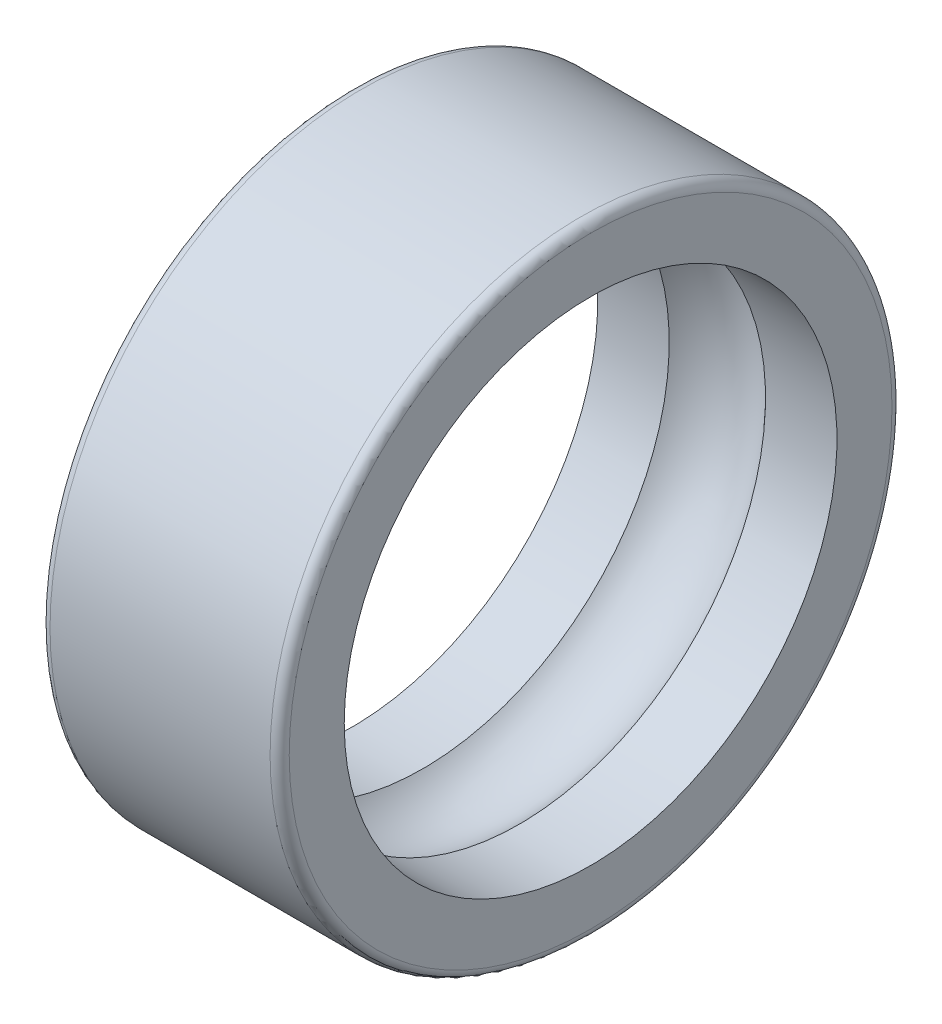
from build123d import *


with BuildPart() as part:
    # Esquisse1 → Base-R_volution (revolve)
    with BuildSketch(Plane(origin=(0, 0, 0), x_dir=(1, 0, 0), z_dir=(0, 1, 0)), mode=Mode.PRIVATE) as base_r_volution_sk:
        with BuildLine():
            Line((0, 6.3), (0, 5.15))
            Line((0, 5.15), (1.49376941, 5.15))
            ThreePointArc((1.49376941, 5.15), (2.5, 5.6), (3.50623059, 5.15))
            Line((3.50623059, 5.15), (5, 5.15))
            Line((5, 5.15), (5, 6.3))
            ThreePointArc((5, 6.3), (4.941421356, 6.441421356), (4.8, 6.5))
            Line((4.8, 6.5), (0.2, 6.5))
            ThreePointArc((0.2, 6.5), (0.058578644, 6.441421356), (0, 6.3))
        make_face()
    revolve(base_r_volution_sk.sketch.rotate(Axis((0, 0, 0), (1, 0, 0)), 180), axis=Axis((0, 0, 0), (1, 0, 0)))


solid = part.part
